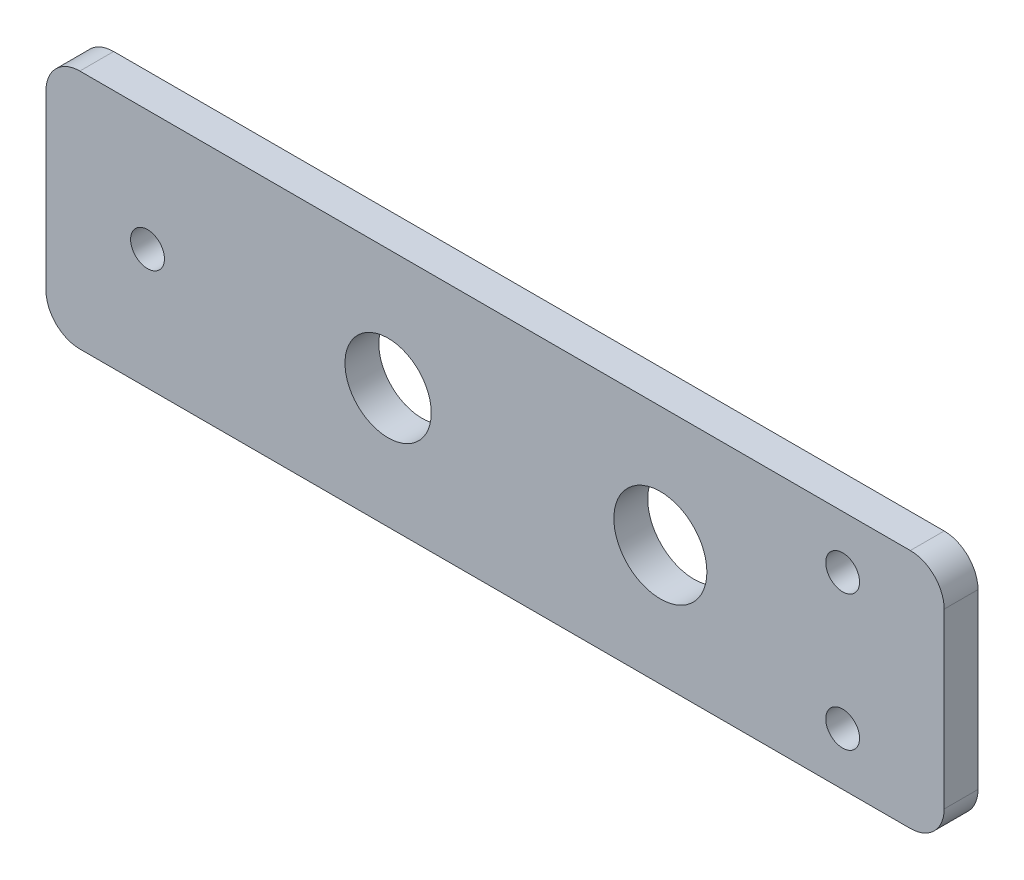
from build123d import *

# Parameters (mm, degrees)
SKETCH1_W           = 67.420991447
SKETCH1_H           = 18.071730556
SKETCH1_R           = 3.4925
SKETCH1_R_2         = 3.2385
SKETCH1_R_3         = 1.27
BOSS_EXTRUDE2_DEPTH = 2.54
FILLET1_R           = 2.54


with BuildPart() as part:
    # Sketch1 → Boss-Extrude2 (new body)
    with BuildSketch(Plane.XY):
        with Locations((-12.40725498, 0)):
            Rectangle(SKETCH1_W, SKETCH1_H)
        Circle(SKETCH1_R, mode=Mode.SUBTRACT)
        with Locations((-20.437013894, 0)):
            Circle(SKETCH1_R_2, mode=Mode.SUBTRACT)
        with Locations((-38.497750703, 0)):
            Circle(SKETCH1_R_3, mode=Mode.SUBTRACT)
        with Locations((13.683240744, 5.08)):
            Circle(SKETCH1_R_3, mode=Mode.SUBTRACT)
        with Locations((13.683240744, -5.08)):
            Circle(SKETCH1_R_3, mode=Mode.SUBTRACT)
    extrude(amount=BOSS_EXTRUDE2_DEPTH)

    # Fillet1
    fillet1_edges = [part.edges().sort_by_distance(p)[0] for p in [
        (21.303240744, -9.035865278, 1.27),
        (-46.117750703, -9.035865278, 1.27),
        (-46.117750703, 9.035865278, 1.27),
        (21.303240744, 9.035865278, 1.27),
    ]]
    fillet(fillet1_edges, radius=FILLET1_R)


solid = part.part
